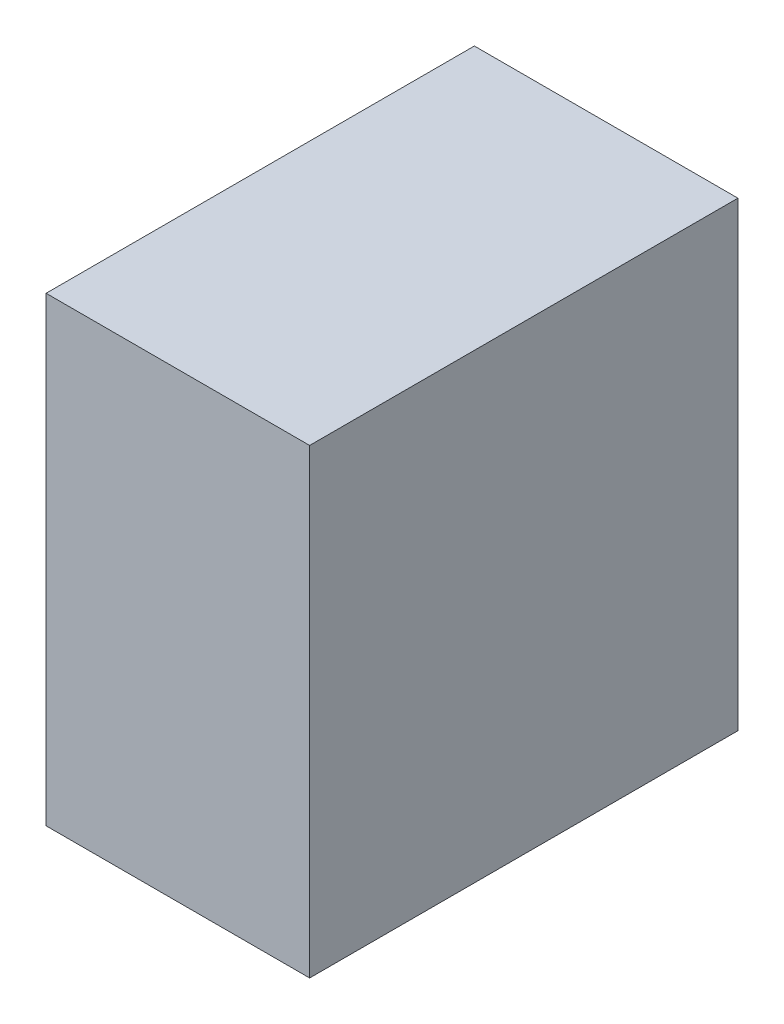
from build123d import *

# Parameters (mm, degrees)
ESQUISSE1_W        = 8
ESQUISSE1_H        = 14
BOSS_EXTRU_1_DEPTH = 13


with BuildPart() as part:
    # Esquisse1 → Boss.-Extru.1 (new body)
    with BuildSketch(Plane.XY):
        with Locations((-34.470524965, 19.297870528)):
            Rectangle(ESQUISSE1_W, ESQUISSE1_H)
    extrude(amount=BOSS_EXTRU_1_DEPTH)


solid = part.part
